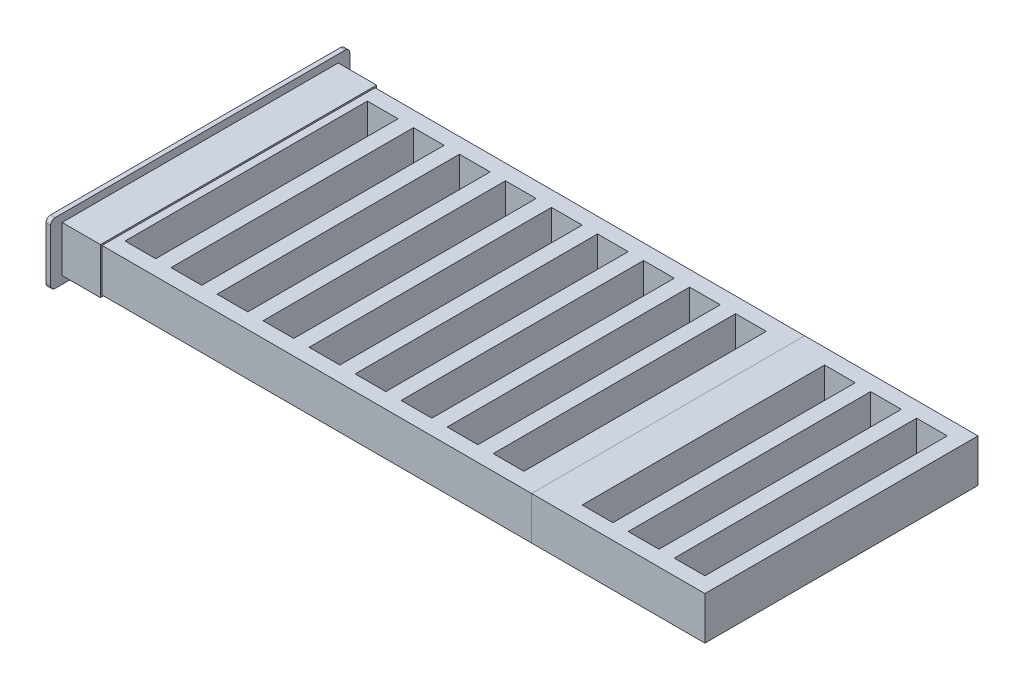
from build123d import *

# Parameters (mm, degrees)
ESQUISSE1_W                = 305
ESQUISSE1_H                = 178
EXTRUSION1_DEPTH           = 14
ESQUISSE2_W                = 195
ESQUISSE2_H                = 40
EXTRUSION2_DEPTH           = 3
CONG_1_R                   = 3
EXTRUSION3_DEPTH           = 1
EXTRUSION3_DEPTH_BACK      = 29
ESQUISSE3_W                = 25
ESQUISSE3_H                = 180
ENL_V_MAT_EXTRU_1_REACH    = 188.661
ESQUISSE4_W                = 20
ESQUISSE4_H                = 158
R_P_TITION_LIN_AIRE1_COUNT = 9
R_P_TITION_LIN_AIRE1_PITCH = 30
ESQUISSE5_W                = 113
ESQUISSE5_H                = 178
ESQUISSE5_W_2              = 20
ESQUISSE5_H_2              = 158
EXTRUSION4_DEPTH           = 28


with BuildPart() as part:
    # Esquisse1 → Extrusion1 (new, symmetric)
    with BuildSketch(Plane(origin=(0, 0, 0), x_dir=(1, 0, 0), z_dir=(0, 1, 0))):
        Rectangle(ESQUISSE1_W, ESQUISSE1_H)
    extrude(amount=EXTRUSION1_DEPTH, both=True)

    # Esquisse2 → Extrusion2 (add)
    with BuildSketch(Plane.ZY.offset(152.5)):
        Rectangle(ESQUISSE2_W, ESQUISSE2_H)
    extrude(amount=EXTRUSION2_DEPTH)

    # Cong_1
    cong_1_edges = [part.edges().sort_by_distance(p)[0] for p in [
        (-154, 20, -97.5),
        (-154, -20, -97.5),
        (-154, -20, 97.5),
        (-154, 20, 97.5),
    ]]
    fillet(cong_1_edges, radius=CONG_1_R)

    # Esquisse3 → Extrusion3 (add, two sides: drawn at the far end of the back side and taken through both)
    with BuildSketch(Plane(origin=(0, 14, 0), x_dir=(-1, 0, 0), z_dir=(0, 1, 0)).offset(-EXTRUSION3_DEPTH_BACK)):
        with Locations((140, 0)):
            Rectangle(ESQUISSE3_W, ESQUISSE3_H)
    extrude(amount=EXTRUSION3_DEPTH + EXTRUSION3_DEPTH_BACK)

    # Esquisse4 → Enl_v. mat.-Extru.1 (cut, up to next)
    with BuildSketch(Plane(origin=(0, 14, 0), x_dir=(-1, 0, 0), z_dir=(0, 1, 0)), mode=Mode.PRIVATE) as enl_v_mat_extru_1_sk1:
        with Locations((112.5, 0)):
            Rectangle(ESQUISSE4_W, ESQUISSE4_H)
    enl_v_mat_extru_1_tool1 = extrude(enl_v_mat_extru_1_sk1.sketch, amount=-ENL_V_MAT_EXTRU_1_REACH, mode=Mode.PRIVATE) & part.part
    enl_v_mat_extru_1 = enl_v_mat_extru_1_tool1.solids().sort_by_distance((-112.5, 14, 0))[0]
    add(enl_v_mat_extru_1, mode=Mode.SUBTRACT)

    # R_p_tition lin_aire1: Enl_v. mat.-Extru.1 ×9
    with Locations(*[(i * R_P_TITION_LIN_AIRE1_PITCH, 0, 0) for i in range(1, R_P_TITION_LIN_AIRE1_COUNT)]):
        add(enl_v_mat_extru_1, mode=Mode.SUBTRACT)


with BuildPart() as body_2:
    # Esquisse5 → Extrusion4 (new body)
    with BuildSketch(Plane(origin=(0, 14, 0), x_dir=(-1, 0, 0), z_dir=(0, 1, 0))):
        with Locations((-209, 0)):
            Rectangle(ESQUISSE5_W, ESQUISSE5_H)
        with Locations((-245.5, 0)):
            Rectangle(ESQUISSE5_W_2, ESQUISSE5_H_2, mode=Mode.SUBTRACT)
        with Locations((-215.5, 0)):
            Rectangle(ESQUISSE5_W_2, ESQUISSE5_H_2, mode=Mode.SUBTRACT)
        with Locations((-185.5, 0)):
            Rectangle(ESQUISSE5_W_2, ESQUISSE5_H_2, mode=Mode.SUBTRACT)
    extrude(amount=-EXTRUSION4_DEPTH)


solid = Compound([part.part, body_2.part])
